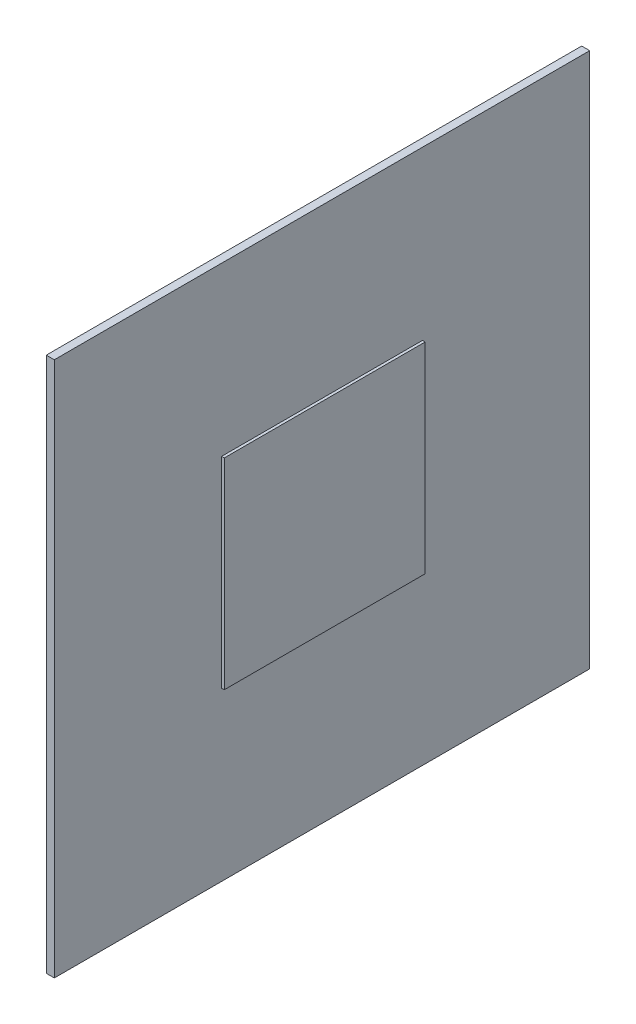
from build123d import *

# Parameters (mm, degrees)
SKETCH1_W           = 50.8
SKETCH1_H           = 50.8
BOSS_EXTRUDE1_DEPTH = 0.762
SKETCH2_W           = 19.05
SKETCH2_H           = 19.05
BOSS_EXTRUDE2_DEPTH = 0.254


with BuildPart() as part:
    # Sketch1 → Boss-Extrude1 (new body)
    with BuildSketch(Plane(origin=(0, 0, 0), x_dir=(0, 0, -1), z_dir=(1, 0, 0))):
        with Locations((25.4, 25.4)):
            Rectangle(SKETCH1_W, SKETCH1_H)
    extrude(amount=BOSS_EXTRUDE1_DEPTH)

    # Sketch2 → Boss-Extrude2 (add)
    with BuildSketch(Plane(origin=(0.762, 0, 0), x_dir=(0, 0, -1), z_dir=(1, 0, 0))):
        with Locations((25.4, 25.4)):
            Rectangle(SKETCH2_W, SKETCH2_H)
    extrude(amount=BOSS_EXTRUDE2_DEPTH)


solid = part.part
